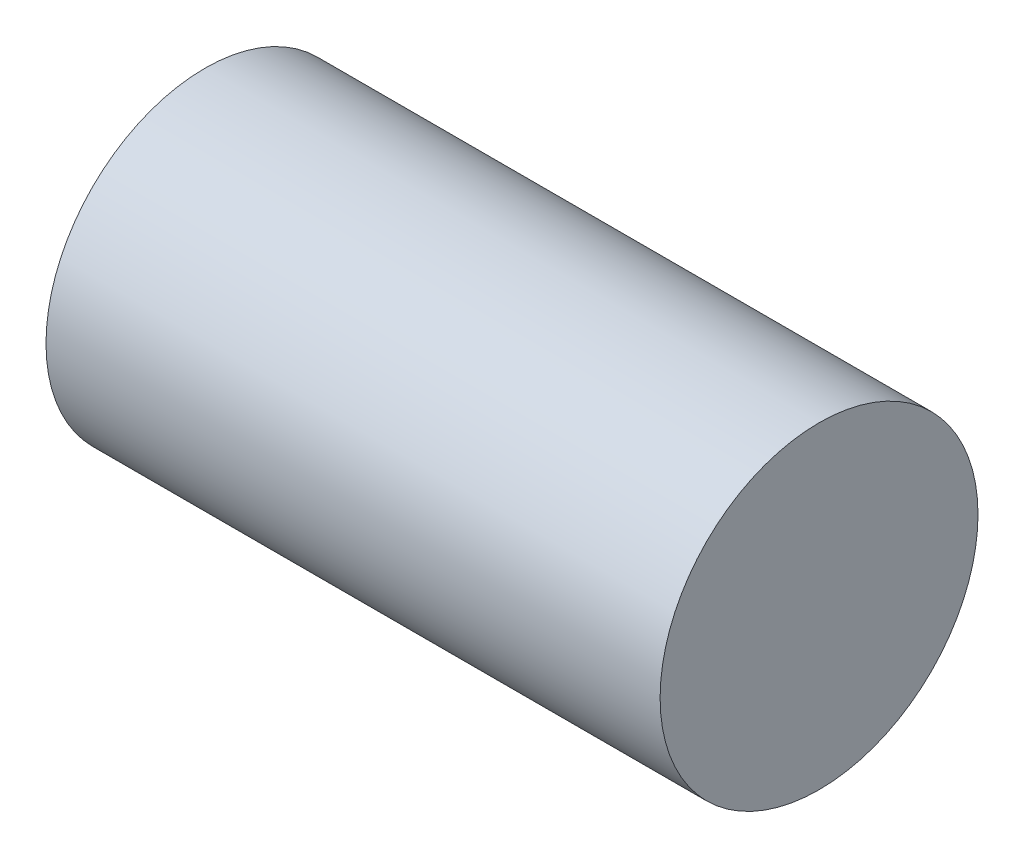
ISO-10303-21;
HEADER;
FILE_DESCRIPTION(('STEP AP214'),'2;1');
FILE_NAME('part.step','',(''),(''),'','','');
FILE_SCHEMA(('AUTOMOTIVE_DESIGN { 1 0 10303 214 1 1 1 1 }'));
ENDSEC;
DATA;
#1=APPLICATION_CONTEXT('core data for automotive mechanical design processes');
#2=APPLICATION_PROTOCOL_DEFINITION('international standard','automotive_design',2000,#1);
#3=PRODUCT_CONTEXT('',#1,'mechanical');
#4=PRODUCT('Part','Part','',(#3));
#5=PRODUCT_RELATED_PRODUCT_CATEGORY('part','',(#4));
#6=PRODUCT_DEFINITION_FORMATION('','',#4);
#7=PRODUCT_DEFINITION_CONTEXT('part definition',#1,'design');
#8=PRODUCT_DEFINITION('design','',#6,#7);
#9=PRODUCT_DEFINITION_SHAPE('','',#8);
#10=(LENGTH_UNIT() NAMED_UNIT(*) SI_UNIT(.MILLI.,.METRE.));
#11=(NAMED_UNIT(*) PLANE_ANGLE_UNIT() SI_UNIT($,.RADIAN.));
#12=(NAMED_UNIT(*) SI_UNIT($,.STERADIAN.) SOLID_ANGLE_UNIT());
#13=UNCERTAINTY_MEASURE_WITH_UNIT(LENGTH_MEASURE(1.E-05),#10,'distance_accuracy_value','');
#14=(GEOMETRIC_REPRESENTATION_CONTEXT(3) GLOBAL_UNCERTAINTY_ASSIGNED_CONTEXT((#13)) GLOBAL_UNIT_ASSIGNED_CONTEXT((#10,
#11,#12)) REPRESENTATION_CONTEXT('',''));
#15=CARTESIAN_POINT('',(0.,0.,0.));
#16=DIRECTION('',(0.,0.,1.));
#17=DIRECTION('',(1.,0.,0.));
#18=AXIS2_PLACEMENT_3D('',#15,#16,#17);
#19=CARTESIAN_POINT('',(42.5,0.,0.));
#20=DIRECTION('',(-1.,0.,0.));
#21=DIRECTION('',(0.,0.,1.));
#22=AXIS2_PLACEMENT_3D('',#19,#20,#21);
#23=CYLINDRICAL_SURFACE('',#22,11.);
#24=CARTESIAN_POINT('',(42.5,0.,0.));
#25=DIRECTION('',(1.,0.,0.));
#26=DIRECTION('',(0.,0.,-1.));
#27=AXIS2_PLACEMENT_3D('',#24,#25,#26);
#28=CIRCLE('',#27,11.);
#29=CARTESIAN_POINT('',(42.5,0.,-11.));
#30=VERTEX_POINT('',#29);
#31=EDGE_CURVE('E10',#30,#30,#28,.T.);
#32=ORIENTED_EDGE('',*,*,#31,.F.);
#33=EDGE_LOOP('',(#32));
#34=FACE_BOUND('',#33,.T.);
#35=CARTESIAN_POINT('',(0.,0.,0.));
#36=DIRECTION('',(1.,0.,0.));
#37=DIRECTION('',(0.,0.,-1.));
#38=AXIS2_PLACEMENT_3D('',#35,#36,#37);
#39=CIRCLE('',#38,11.);
#40=CARTESIAN_POINT('',(0.,0.,-11.));
#41=VERTEX_POINT('',#40);
#42=EDGE_CURVE('E35',#41,#41,#39,.T.);
#43=ORIENTED_EDGE('',*,*,#42,.T.);
#44=EDGE_LOOP('',(#43));
#45=FACE_BOUND('',#44,.T.);
#46=ADVANCED_FACE('F29',(#34,#45),#23,.T.);
#47=CARTESIAN_POINT('',(42.5,0.,0.));
#48=DIRECTION('',(1.,0.,0.));
#49=DIRECTION('',(0.,0.,-1.));
#50=AXIS2_PLACEMENT_3D('',#47,#48,#49);
#51=PLANE('',#50);
#52=ORIENTED_EDGE('',*,*,#31,.T.);
#53=EDGE_LOOP('',(#52));
#54=FACE_BOUND('',#53,.T.);
#55=ADVANCED_FACE('F44',(#54),#51,.T.);
#56=CARTESIAN_POINT('',(0.,0.,0.));
#57=DIRECTION('',(1.,0.,0.));
#58=DIRECTION('',(0.,0.,-1.));
#59=AXIS2_PLACEMENT_3D('',#56,#57,#58);
#60=PLANE('',#59);
#61=ORIENTED_EDGE('',*,*,#42,.F.);
#62=EDGE_LOOP('',(#61));
#63=FACE_BOUND('',#62,.T.);
#64=ADVANCED_FACE('F42',(#63),#60,.F.);
#65=CLOSED_SHELL('',(#46,#55,#64));
#66=MANIFOLD_SOLID_BREP('B2',#65);
#67=ADVANCED_BREP_SHAPE_REPRESENTATION('',(#18,#66),#14);
#68=SHAPE_DEFINITION_REPRESENTATION(#9,#67);
ENDSEC;
END-ISO-10303-21;
